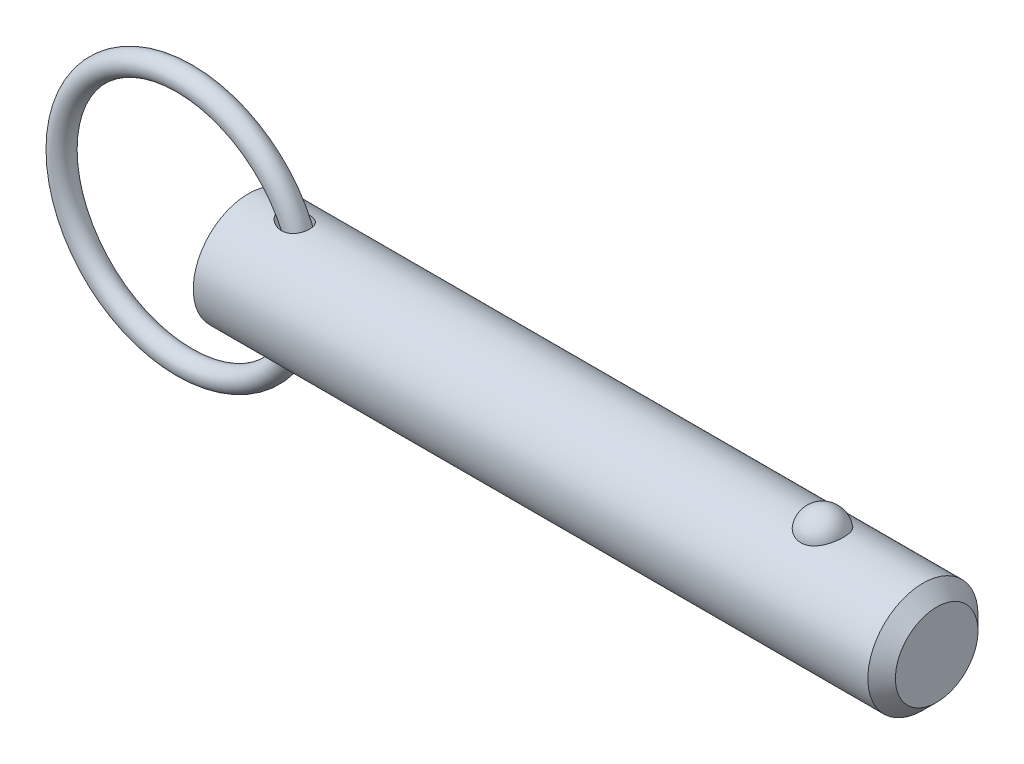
ISO-10303-21;
HEADER;
FILE_DESCRIPTION(('STEP AP214'),'2;1');
FILE_NAME('part.step','',(''),(''),'','','');
FILE_SCHEMA(('AUTOMOTIVE_DESIGN { 1 0 10303 214 1 1 1 1 }'));
ENDSEC;
DATA;
#1=APPLICATION_CONTEXT('core data for automotive mechanical design processes');
#2=APPLICATION_PROTOCOL_DEFINITION('international standard','automotive_design',2000,#1);
#3=PRODUCT_CONTEXT('',#1,'mechanical');
#4=PRODUCT('Part','Part','',(#3));
#5=PRODUCT_RELATED_PRODUCT_CATEGORY('part','',(#4));
#6=PRODUCT_DEFINITION_FORMATION('','',#4);
#7=PRODUCT_DEFINITION_CONTEXT('part definition',#1,'design');
#8=PRODUCT_DEFINITION('design','',#6,#7);
#9=PRODUCT_DEFINITION_SHAPE('','',#8);
#10=(LENGTH_UNIT() NAMED_UNIT(*) SI_UNIT(.MILLI.,.METRE.));
#11=(NAMED_UNIT(*) PLANE_ANGLE_UNIT() SI_UNIT($,.RADIAN.));
#12=(NAMED_UNIT(*) SI_UNIT($,.STERADIAN.) SOLID_ANGLE_UNIT());
#13=UNCERTAINTY_MEASURE_WITH_UNIT(LENGTH_MEASURE(1.E-05),#10,'distance_accuracy_value','');
#14=(GEOMETRIC_REPRESENTATION_CONTEXT(3) GLOBAL_UNCERTAINTY_ASSIGNED_CONTEXT((#13)) GLOBAL_UNIT_ASSIGNED_CONTEXT((#10,
#11,#12)) REPRESENTATION_CONTEXT('',''));
#15=CARTESIAN_POINT('',(0.,0.,0.));
#16=DIRECTION('',(0.,0.,1.));
#17=DIRECTION('',(1.,0.,0.));
#18=AXIS2_PLACEMENT_3D('',#15,#16,#17);
#19=CARTESIAN_POINT('',(-8.23730968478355,0.,0.));
#20=DIRECTION('',(0.,0.,1.));
#21=DIRECTION('',(1.,0.,0.));
#22=AXIS2_PLACEMENT_3D('',#19,#20,#21);
#23=TOROIDAL_SURFACE('',#22,15.875,1.422);
#24=CARTESIAN_POINT('',(9.05969031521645,0.,0.));
#25=VERTEX_POINT('',#24);
#26=VERTEX_LOOP('',#25);
#27=FACE_BOUND('',#26,.T.);
#28=ADVANCED_FACE('P0_F12',(#27),#23,.T.);
#29=CLOSED_SHELL('',(#28));
#30=MANIFOLD_SOLID_BREP('P0_B1',#29);
#31=CARTESIAN_POINT('',(0.,0.,0.));
#32=DIRECTION('',(1.,0.,0.));
#33=DIRECTION('',(0.,0.,-1.));
#34=AXIS2_PLACEMENT_3D('',#31,#32,#33);
#35=CYLINDRICAL_SURFACE('',#34,7.11);
#36=CARTESIAN_POINT('',(3.98467340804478,7.10072679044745,-0.363013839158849));
#37=CARTESIAN_POINT('',(4.00971652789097,7.09600153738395,-0.45539194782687));
#38=CARTESIAN_POINT('',(4.04401947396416,7.08958406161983,-0.545230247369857));
#39=CARTESIAN_POINT('',(4.12810160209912,7.07427055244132,-0.717157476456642));
#40=CARTESIAN_POINT('',(4.17791765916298,7.06536861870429,-0.799227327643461));
#41=CARTESIAN_POINT('',(4.28924471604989,7.04620300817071,-0.953469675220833));
#42=CARTESIAN_POINT('',(4.35063580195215,7.035953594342,-1.02573162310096));
#43=CARTESIAN_POINT('',(4.48282610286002,7.01493313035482,-1.16081412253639));
#44=CARTESIAN_POINT('',(4.55362244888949,7.00416223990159,-1.22363754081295));
#45=CARTESIAN_POINT('',(4.71659336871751,6.98090398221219,-1.35055080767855));
#46=CARTESIAN_POINT('',(4.81029272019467,6.96847103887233,-1.41269256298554));
#47=CARTESIAN_POINT('',(5.0057240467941,6.94515366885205,-1.52319699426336));
#48=CARTESIAN_POINT('',(5.10746392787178,6.93427079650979,-1.57154588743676));
#49=CARTESIAN_POINT('',(5.33503739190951,6.91346066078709,-1.66091325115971));
#50=CARTESIAN_POINT('',(5.46199550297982,6.90402388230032,-1.69921932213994));
#51=CARTESIAN_POINT('',(5.72084799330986,6.89024030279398,-1.75428261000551));
#52=CARTESIAN_POINT('',(5.85274301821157,6.88589416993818,-1.77103699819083));
#53=CARTESIAN_POINT('',(6.11557710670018,6.88337277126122,-1.78081990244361));
#54=CARTESIAN_POINT('',(6.24650031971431,6.88510489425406,-1.77420448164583));
#55=CARTESIAN_POINT('',(6.50446311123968,6.89478744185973,-1.73620392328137));
#56=CARTESIAN_POINT('',(6.6315075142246,6.90272978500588,-1.70485097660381));
#57=CARTESIAN_POINT('',(6.85933269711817,6.92243075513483,-1.62281888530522));
#58=CARTESIAN_POINT('',(6.96133251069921,6.93352131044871,-1.5753580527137));
#59=CARTESIAN_POINT('',(7.15436649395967,6.95824811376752,-1.46226310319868));
#60=CARTESIAN_POINT('',(7.24540699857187,6.97188287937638,-1.3966395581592));
#61=CARTESIAN_POINT('',(7.40446019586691,6.99838217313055,-1.25668991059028));
#62=CARTESIAN_POINT('',(7.473875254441,7.01118308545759,-1.18393777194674));
#63=CARTESIAN_POINT('',(7.59904891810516,7.03582803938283,-1.02736918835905));
#64=CARTESIAN_POINT('',(7.65481029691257,7.04767227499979,-0.943554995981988));
#65=CARTESIAN_POINT('',(7.74982438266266,7.06873077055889,-0.76979592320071));
#66=CARTESIAN_POINT('',(7.7894903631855,7.07800861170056,-0.680084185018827));
#67=CARTESIAN_POINT('',(7.85354088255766,7.09334756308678,-0.495102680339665));
#68=CARTESIAN_POINT('',(7.87792559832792,7.09940871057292,-0.399832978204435));
#69=CARTESIAN_POINT('',(7.9108898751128,7.10766731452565,-0.206294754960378));
#70=CARTESIAN_POINT('',(7.91944662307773,7.10985919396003,-0.108022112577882));
#71=CARTESIAN_POINT('',(7.920501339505,7.11012756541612,0.0886168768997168));
#72=CARTESIAN_POINT('',(7.91299895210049,7.10820396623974,0.186983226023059));
#73=CARTESIAN_POINT('',(7.88205794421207,7.10043733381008,0.381270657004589));
#74=CARTESIAN_POINT('',(7.85857985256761,7.09458459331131,0.477185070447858));
#75=CARTESIAN_POINT('',(7.79617406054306,7.07958431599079,0.663575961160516));
#76=CARTESIAN_POINT('',(7.75724672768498,7.07043685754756,0.754052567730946));
#77=CARTESIAN_POINT('',(7.66496731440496,7.04987259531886,0.926798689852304));
#78=CARTESIAN_POINT('',(7.61164530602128,7.0384605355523,1.00908483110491));
#79=CARTESIAN_POINT('',(7.49191707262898,7.01461776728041,1.16333092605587));
#80=CARTESIAN_POINT('',(7.42551210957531,7.00218715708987,1.235291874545));
#81=CARTESIAN_POINT('',(7.28164031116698,6.97770944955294,1.36680167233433));
#82=CARTESIAN_POINT('',(7.20420170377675,6.96566146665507,1.42638126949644));
#83=CARTESIAN_POINT('',(7.0403906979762,6.94319963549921,1.53199377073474));
#84=CARTESIAN_POINT('',(6.95401827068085,6.93278579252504,1.57802663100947));
#85=CARTESIAN_POINT('',(6.7731858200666,6.91444459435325,1.65656940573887));
#86=CARTESIAN_POINT('',(6.67860569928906,6.90656682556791,1.68881327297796));
#87=CARTESIAN_POINT('',(6.48544119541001,6.89422806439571,1.73849768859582));
#88=CARTESIAN_POINT('',(6.38685561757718,6.88976809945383,1.755933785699));
#89=CARTESIAN_POINT('',(6.18089829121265,6.88429907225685,1.77726234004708));
#90=CARTESIAN_POINT('',(6.07340937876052,6.88356485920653,1.78007646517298));
#91=CARTESIAN_POINT('',(5.85921220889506,6.886086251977,1.77029087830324));
#92=CARTESIAN_POINT('',(5.75250426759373,6.88934339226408,1.75768523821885));
#93=CARTESIAN_POINT('',(5.52848027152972,6.89994454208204,1.71563399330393));
#94=CARTESIAN_POINT('',(5.41155168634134,6.90775772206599,1.68424184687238));
#95=CARTESIAN_POINT('',(5.18376466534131,6.92670168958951,1.60454711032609));
#96=CARTESIAN_POINT('',(5.07291446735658,6.9378368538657,1.5562221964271));
#97=CARTESIAN_POINT('',(4.84835244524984,6.96347168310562,1.43744827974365));
#98=CARTESIAN_POINT('',(4.73562531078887,6.97820486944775,1.36517310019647));
#99=CARTESIAN_POINT('',(4.52504912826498,7.00822340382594,1.20158053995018));
#100=CARTESIAN_POINT('',(4.42717478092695,7.02350775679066,1.11029618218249));
#101=CARTESIAN_POINT('',(4.27935716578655,7.04784659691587,0.940654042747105));
#102=CARTESIAN_POINT('',(4.2239722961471,7.05736064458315,0.867099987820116));
#103=CARTESIAN_POINT('',(4.12558347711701,7.07469854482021,0.711919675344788));
#104=CARTESIAN_POINT('',(4.08256922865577,7.0825238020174,0.630300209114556));
#105=CARTESIAN_POINT('',(4.01142860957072,7.09565978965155,0.459428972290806));
#106=CARTESIAN_POINT('',(3.98346043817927,7.10094374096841,0.370107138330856));
#107=CARTESIAN_POINT('',(3.95517285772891,7.1063173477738,0.233358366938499));
#108=CARTESIAN_POINT('',(3.94802115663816,7.1076831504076,0.187321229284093));
#109=CARTESIAN_POINT('',(3.93842121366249,7.10951900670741,0.0947476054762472));
#110=CARTESIAN_POINT('',(3.93597129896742,7.10998937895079,0.0482113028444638));
#111=CARTESIAN_POINT('',(3.93584361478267,7.11001358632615,-0.0598597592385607));
#112=CARTESIAN_POINT('',(3.9399538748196,7.10922402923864,-0.121405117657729));
#113=CARTESIAN_POINT('',(3.95632793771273,7.10609781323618,-0.243320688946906));
#114=CARTESIAN_POINT('',(3.96859135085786,7.10376122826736,-0.303690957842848));
#115=CARTESIAN_POINT('',(3.98467340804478,7.10072679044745,-0.363013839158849));
#116=B_SPLINE_CURVE_WITH_KNOTS('',3,(#36,#37,#38,#39,#40,#41,#42,#43,#44,#45,#46,#47,#48,#49,
#50,#51,#52,#53,#54,#55,#56,#57,#58,#59,#60,#61,#62,#63,#64,#65,#66,#67,#68,#69,#70,#71,#72,#73,
#74,#75,#76,#77,#78,#79,#80,#81,#82,#83,#84,#85,#86,#87,#88,#89,#90,#91,#92,#93,#94,#95,#96,#97,
#98,#99,#100,#101,#102,#103,#104,#105,#106,#107,#108,#109,#110,#111,#112,#113,#114,#115),
.UNSPECIFIED.,.T.,.F.,(4,2,2,2,2,2,2,2,2,2,2,2,2,2,2,2,2,2,2,2,2,2,2,2,2,2,2,2,2,2,2,2,2,2,2,2,
2,2,2,4),(0.,0.287206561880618,0.575101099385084,0.860162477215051,1.14513709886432,
1.48324846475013,1.82169652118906,2.21865672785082,2.6156690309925,3.00665870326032,
3.39714041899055,3.73437585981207,4.07141541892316,4.37402271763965,4.67656849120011,
4.97076150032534,5.26495110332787,5.55956439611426,5.85418421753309,6.14953461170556,
6.44487798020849,6.73960905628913,7.03431171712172,7.32827352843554,7.6222362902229,
7.9216396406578,8.22113296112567,8.54242840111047,8.86384740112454,9.22635035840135,
9.58933304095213,9.99153142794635,10.3930368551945,10.6697219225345,10.9461759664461,
11.2254825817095,11.3650959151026,11.5046595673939,11.6891051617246,11.8735419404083),.UNSPECIFIED.);
#117=CARTESIAN_POINT('',(3.98467340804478,7.10072679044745,-0.363013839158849));
#118=VERTEX_POINT('',#117);
#119=EDGE_CURVE('P1_E40',#118,#118,#116,.T.);
#120=ORIENTED_EDGE('',*,*,#119,.T.);
#121=EDGE_LOOP('',(#120));
#122=FACE_BOUND('',#121,.T.);
#123=CARTESIAN_POINT('',(87.0925,0.,0.));
#124=DIRECTION('',(1.,0.,0.));
#125=DIRECTION('',(0.,0.,-1.));
#126=AXIS2_PLACEMENT_3D('',#123,#124,#125);
#127=CIRCLE('',#126,7.11);
#128=CARTESIAN_POINT('',(87.0925,0.,-7.11));
#129=VERTEX_POINT('',#128);
#130=EDGE_CURVE('P1_E25',#129,#129,#127,.T.);
#131=ORIENTED_EDGE('',*,*,#130,.F.);
#132=EDGE_LOOP('',(#131));
#133=FACE_BOUND('',#132,.T.);
#134=CARTESIAN_POINT('',(0.,0.,0.));
#135=DIRECTION('',(1.,0.,0.));
#136=DIRECTION('',(0.,0.,-1.));
#137=AXIS2_PLACEMENT_3D('',#134,#135,#136);
#138=CIRCLE('',#137,7.11);
#139=CARTESIAN_POINT('',(0.,0.,-7.11));
#140=VERTEX_POINT('',#139);
#141=EDGE_CURVE('P1_E9',#140,#140,#138,.T.);
#142=ORIENTED_EDGE('',*,*,#141,.T.);
#143=EDGE_LOOP('',(#142));
#144=FACE_BOUND('',#143,.T.);
#145=CARTESIAN_POINT('',(74.129258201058,6.5364666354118,2.79762469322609));
#146=CARTESIAN_POINT('',(73.9844296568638,6.53647876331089,2.79761243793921));
#147=CARTESIAN_POINT('',(73.839368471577,6.54144531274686,2.78608115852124));
#148=CARTESIAN_POINT('',(73.5532920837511,6.56077791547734,2.7402328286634));
#149=CARTESIAN_POINT('',(73.4122884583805,6.5751685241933,2.7058562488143));
#150=CARTESIAN_POINT('',(73.1388833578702,6.61165072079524,2.61544042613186));
#151=CARTESIAN_POINT('',(73.0064602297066,6.63372195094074,2.55945840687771));
#152=CARTESIAN_POINT('',(72.7532337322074,6.68316012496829,2.42742958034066));
#153=CARTESIAN_POINT('',(72.6324254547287,6.71052481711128,2.35139129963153));
#154=CARTESIAN_POINT('',(72.4016372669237,6.76860821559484,2.17866150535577));
#155=CARTESIAN_POINT('',(72.2920857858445,6.79940242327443,2.0814234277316));
#156=CARTESIAN_POINT('',(72.0903340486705,6.86050242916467,1.87020907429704));
#157=CARTESIAN_POINT('',(71.9981390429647,6.89080807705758,1.75622775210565));
#158=CARTESIAN_POINT('',(71.8292547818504,6.94923069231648,1.50900646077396));
#159=CARTESIAN_POINT('',(71.7534289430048,6.97719213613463,1.37513873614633));
#160=CARTESIAN_POINT('',(71.6242063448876,7.02647251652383,1.09584817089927));
#161=CARTESIAN_POINT('',(71.5708109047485,7.04779106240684,0.95042465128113));
#162=CARTESIAN_POINT('',(71.4871019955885,7.08180248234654,0.650508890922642));
#163=CARTESIAN_POINT('',(71.4570253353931,7.09440672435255,0.495940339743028));
#164=CARTESIAN_POINT('',(71.4214735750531,7.10935121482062,0.183515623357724));
#165=CARTESIAN_POINT('',(71.4159974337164,7.11169189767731,0.0256595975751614));
#166=CARTESIAN_POINT('',(71.429700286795,7.10589702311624,-0.28751219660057));
#167=CARTESIAN_POINT('',(71.4486823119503,7.0978451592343,-0.442838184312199));
#168=CARTESIAN_POINT('',(71.5105745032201,7.07221860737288,-0.747830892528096));
#169=CARTESIAN_POINT('',(71.5534850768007,7.05464375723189,-0.897497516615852));
#170=CARTESIAN_POINT('',(71.6624527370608,7.01171031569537,-1.18722864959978));
#171=CARTESIAN_POINT('',(71.7285458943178,6.98633960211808,-1.32727778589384));
#172=CARTESIAN_POINT('',(71.8825362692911,6.93042258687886,-1.59370324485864));
#173=CARTESIAN_POINT('',(71.9704355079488,6.89987580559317,-1.72007829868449));
#174=CARTESIAN_POINT('',(72.1669269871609,6.83659510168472,-1.95657345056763));
#175=CARTESIAN_POINT('',(72.2756640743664,6.80384697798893,-2.06656957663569));
#176=CARTESIAN_POINT('',(72.5109686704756,6.74001831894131,-2.26611005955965));
#177=CARTESIAN_POINT('',(72.6375350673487,6.70893767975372,-2.35565569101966));
#178=CARTESIAN_POINT('',(72.9028454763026,6.6526444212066,-2.51019726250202));
#179=CARTESIAN_POINT('',(73.0413230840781,6.62733449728,-2.57561395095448));
#180=CARTESIAN_POINT('',(73.3285194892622,6.58495995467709,-2.68211134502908));
#181=CARTESIAN_POINT('',(73.4772343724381,6.56789220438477,-2.7232012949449));
#182=CARTESIAN_POINT('',(73.7726268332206,6.54478663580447,-2.77825810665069));
#183=CARTESIAN_POINT('',(73.9190295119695,6.53823639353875,-2.79348727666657));
#184=CARTESIAN_POINT('',(74.2124700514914,6.53532718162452,-2.80028921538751));
#185=CARTESIAN_POINT('',(74.3595077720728,6.53896606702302,-2.79186696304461));
#186=CARTESIAN_POINT('',(74.6449210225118,6.55570357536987,-2.75232178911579));
#187=CARTESIAN_POINT('',(74.7834221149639,6.56848455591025,-2.72196077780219));
#188=CARTESIAN_POINT('',(75.0531142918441,6.60173528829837,-2.64028774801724));
#189=CARTESIAN_POINT('',(75.184304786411,6.62220565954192,-2.58897404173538));
#190=CARTESIAN_POINT('',(75.4388462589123,6.6691792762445,-2.46547820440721));
#191=CARTESIAN_POINT('',(75.5619691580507,6.69580233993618,-2.39287266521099));
#192=CARTESIAN_POINT('',(75.7944418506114,6.75207041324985,-2.22915269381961));
#193=CARTESIAN_POINT('',(75.9037884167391,6.78171612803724,-2.13803393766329));
#194=CARTESIAN_POINT('',(76.111642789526,6.84264629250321,-1.93445592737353));
#195=CARTESIAN_POINT('',(76.2093178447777,6.87393748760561,-1.82114774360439));
#196=CARTESIAN_POINT('',(76.3850112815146,6.93345710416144,-1.57947787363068));
#197=CARTESIAN_POINT('',(76.4630261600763,6.96168497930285,-1.45111351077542));
#198=CARTESIAN_POINT('',(76.5999857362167,7.01307558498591,-1.17842708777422));
#199=CARTESIAN_POINT('',(76.6582588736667,7.03605262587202,-1.03373189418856));
#200=CARTESIAN_POINT('',(76.7510815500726,7.07340932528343,-0.735867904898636));
#201=CARTESIAN_POINT('',(76.7856311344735,7.08778900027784,-0.582699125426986));
#202=CARTESIAN_POINT('',(76.830274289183,7.10647639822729,-0.272420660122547));
#203=CARTESIAN_POINT('',(76.84039710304,7.11079616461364,-0.115315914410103));
#204=CARTESIAN_POINT('',(76.836061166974,7.10896059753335,0.198488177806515));
#205=CARTESIAN_POINT('',(76.8216031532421,7.10280557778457,0.355187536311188));
#206=CARTESIAN_POINT('',(76.7685727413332,7.08071500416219,0.662724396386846));
#207=CARTESIAN_POINT('',(76.7301505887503,7.06484039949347,0.813592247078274));
#208=CARTESIAN_POINT('',(76.630101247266,7.02495896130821,1.10629159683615));
#209=CARTESIAN_POINT('',(76.5684724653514,7.00095156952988,1.24812247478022));
#210=CARTESIAN_POINT('',(76.4227668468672,6.94706632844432,1.51976439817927));
#211=CARTESIAN_POINT('',(76.3385448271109,6.91715085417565,1.64949012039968));
#212=CARTESIAN_POINT('',(76.1495861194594,6.8547056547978,1.89231285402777));
#213=CARTESIAN_POINT('',(76.0448501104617,6.82217601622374,2.00541041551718));
#214=CARTESIAN_POINT('',(75.8171030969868,6.75805358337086,2.21190674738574));
#215=CARTESIAN_POINT('',(75.694082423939,6.72646129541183,2.30529503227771));
#216=CARTESIAN_POINT('',(75.4327347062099,6.66789520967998,2.46959908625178));
#217=CARTESIAN_POINT('',(75.2944019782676,6.64092313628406,2.54050647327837));
#218=CARTESIAN_POINT('',(75.0111828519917,6.59572583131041,2.65560045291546));
#219=CARTESIAN_POINT('',(74.8666660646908,6.57724013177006,2.70059539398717));
#220=CARTESIAN_POINT('',(74.5715469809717,6.55006426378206,2.76587321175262));
#221=CARTESIAN_POINT('',(74.4209640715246,6.54134511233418,2.78622922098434));
#222=CARTESIAN_POINT('',(74.2230463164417,6.53697847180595,2.79642434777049));
#223=CARTESIAN_POINT('',(74.1761644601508,6.53646270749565,2.79762866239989));
#224=CARTESIAN_POINT('',(74.129258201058,6.5364666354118,2.79762469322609));
#225=B_SPLINE_CURVE_WITH_KNOTS('',3,(#145,#146,#147,#148,#149,#150,#151,#152,#153,#154,#155,
#156,#157,#158,#159,#160,#161,#162,#163,#164,#165,#166,#167,#168,#169,#170,#171,#172,#173,#174,
#175,#176,#177,#178,#179,#180,#181,#182,#183,#184,#185,#186,#187,#188,#189,#190,#191,#192,#193,
#194,#195,#196,#197,#198,#199,#200,#201,#202,#203,#204,#205,#206,#207,#208,#209,#210,#211,#212,
#213,#214,#215,#216,#217,#218,#219,#220,#221,#222,#223,#224),.UNSPECIFIED.,.T.,.F.,(4,2,2,2,2,2,
2,2,2,2,2,2,2,2,2,2,2,2,2,2,2,2,2,2,2,2,2,2,2,2,2,2,2,2,2,2,2,2,2,4),(0.,0.434355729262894,
0.869847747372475,1.30419416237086,1.73835621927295,2.18541922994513,2.63261726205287,
3.09954261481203,3.56649542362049,4.03813031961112,4.5097452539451,4.97758575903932,
5.44543423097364,5.91401389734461,6.38263700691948,6.85464418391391,7.32662193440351,
7.78992971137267,8.25306131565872,8.69285754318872,9.13256119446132,9.5576862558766,
9.9828455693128,10.4171106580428,10.8514772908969,11.3079089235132,11.7644218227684,
12.2351898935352,12.7059570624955,13.1761603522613,13.6463495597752,14.1136200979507,
14.580922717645,15.0513032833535,15.5216682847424,15.9922828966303,16.4630727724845,
16.9182457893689,17.3720644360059,17.5127411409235),.UNSPECIFIED.);
#226=CARTESIAN_POINT('',(74.129258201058,6.5364666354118,2.79762469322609));
#227=VERTEX_POINT('',#226);
#228=EDGE_CURVE('P1_E34',#227,#227,#225,.T.);
#229=ORIENTED_EDGE('',*,*,#228,.T.);
#230=EDGE_LOOP('',(#229));
#231=FACE_BOUND('',#230,.T.);
#232=CARTESIAN_POINT('',(3.98467340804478,-7.10072679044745,-0.363013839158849));
#233=CARTESIAN_POINT('',(3.96426456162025,-7.10457733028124,-0.287714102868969));
#234=CARTESIAN_POINT('',(3.95000501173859,-7.10730349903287,-0.210695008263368));
#235=CARTESIAN_POINT('',(3.93481801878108,-7.11020840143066,-0.0553038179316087));
#236=CARTESIAN_POINT('',(3.93388435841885,-7.11038832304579,0.0230676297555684));
#237=CARTESIAN_POINT('',(3.94541910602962,-7.10817995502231,0.178714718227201));
#238=CARTESIAN_POINT('',(3.95787987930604,-7.10579312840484,0.25599095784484));
#239=CARTESIAN_POINT('',(3.99523775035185,-7.09872642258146,0.407352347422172));
#240=CARTESIAN_POINT('',(4.02014065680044,-7.09404547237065,0.481435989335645));
#241=CARTESIAN_POINT('',(4.08119600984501,-7.08278363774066,0.625775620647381));
#242=CARTESIAN_POINT('',(4.11749458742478,-7.07617815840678,0.695967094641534));
#243=CARTESIAN_POINT('',(4.19940836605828,-7.06165305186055,0.830508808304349));
#244=CARTESIAN_POINT('',(4.24502952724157,-7.0537325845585,0.894855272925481));
#245=CARTESIAN_POINT('',(4.36790232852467,-7.03310314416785,1.04688574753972));
#246=CARTESIAN_POINT('',(4.44977459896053,-7.01993229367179,1.13078695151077));
#247=CARTESIAN_POINT('',(4.62610796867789,-6.99351259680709,1.28411726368));
#248=CARTESIAN_POINT('',(4.7205898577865,-6.98026365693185,1.35352197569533));
#249=CARTESIAN_POINT('',(4.92036507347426,-6.9549104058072,1.47831921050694));
#250=CARTESIAN_POINT('',(5.02579054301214,-6.94282458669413,1.53350332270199));
#251=CARTESIAN_POINT('',(5.24378330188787,-6.92129098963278,1.62793610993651));
#252=CARTESIAN_POINT('',(5.35635066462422,-6.91184323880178,1.66718462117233));
#253=CARTESIAN_POINT('',(5.60134354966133,-6.89573491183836,1.73269893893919));
#254=CARTESIAN_POINT('',(5.73444697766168,-6.8895970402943,1.75661057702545));
#255=CARTESIAN_POINT('',(6.00300738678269,-6.88344616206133,1.78057487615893));
#256=CARTESIAN_POINT('',(6.13846360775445,-6.88343121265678,1.78063510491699));
#257=CARTESIAN_POINT('',(6.39660470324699,-6.88981379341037,1.75576480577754));
#258=CARTESIAN_POINT('',(6.51947843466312,-6.89572457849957,1.73273121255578));
#259=CARTESIAN_POINT('',(6.75813770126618,-6.91274434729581,1.66352936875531));
#260=CARTESIAN_POINT('',(6.87393155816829,-6.92384709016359,1.61738888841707));
#261=CARTESIAN_POINT('',(7.07801861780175,-6.94787316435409,1.51052664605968));
#262=CARTESIAN_POINT('',(7.16789841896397,-6.96033024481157,1.45271574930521));
#263=CARTESIAN_POINT('',(7.33546773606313,-6.98638661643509,1.32171912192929));
#264=CARTESIAN_POINT('',(7.41316182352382,-6.99998547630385,1.24853918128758));
#265=CARTESIAN_POINT('',(7.54861420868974,-7.02559503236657,1.09486170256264));
#266=CARTESIAN_POINT('',(7.60741145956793,-7.03764930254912,1.01528346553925));
#267=CARTESIAN_POINT('',(7.71070740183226,-7.0598657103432,0.847099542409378));
#268=CARTESIAN_POINT('',(7.75520788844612,-7.0700280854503,0.758494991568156));
#269=CARTESIAN_POINT('',(7.82836147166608,-7.08722075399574,0.575936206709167));
#270=CARTESIAN_POINT('',(7.85719783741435,-7.09428707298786,0.482058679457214));
#271=CARTESIAN_POINT('',(7.89918378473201,-7.10470260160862,0.29065874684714));
#272=CARTESIAN_POINT('',(7.91233308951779,-7.10805174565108,0.193136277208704));
#273=CARTESIAN_POINT('',(7.92267451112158,-7.11067890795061,-0.00313968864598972));
#274=CARTESIAN_POINT('',(7.91981203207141,-7.10994299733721,-0.10189624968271));
#275=CARTESIAN_POINT('',(7.89806489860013,-7.10444651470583,-0.297516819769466));
#276=CARTESIAN_POINT('',(7.87918005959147,-7.09968589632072,-0.394380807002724));
#277=CARTESIAN_POINT('',(7.82577988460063,-7.0866471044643,-0.58355375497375));
#278=CARTESIAN_POINT('',(7.79124976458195,-7.07836560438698,-0.675858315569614));
#279=CARTESIAN_POINT('',(7.70736343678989,-7.05919003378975,-0.853167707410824));
#280=CARTESIAN_POINT('',(7.65800801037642,-7.04829610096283,-0.938172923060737));
#281=CARTESIAN_POINT('',(7.54590141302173,-7.02513961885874,-1.09819812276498));
#282=CARTESIAN_POINT('',(7.48319521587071,-7.01288172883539,-1.17325029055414));
#283=CARTESIAN_POINT('',(7.34599775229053,-6.98832192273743,-1.31164333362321));
#284=CARTESIAN_POINT('',(7.27150757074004,-6.97602001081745,-1.37498528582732));
#285=CARTESIAN_POINT('',(7.11277776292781,-6.95268608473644,-1.48849974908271));
#286=CARTESIAN_POINT('',(7.02852525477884,-6.94165578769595,-1.53865456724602));
#287=CARTESIAN_POINT('',(6.85282430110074,-6.92200320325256,-1.62478650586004));
#288=CARTESIAN_POINT('',(6.76137511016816,-6.91338116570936,-1.66076215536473));
#289=CARTESIAN_POINT('',(6.57061179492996,-6.89906044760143,-1.71930563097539));
#290=CARTESIAN_POINT('',(6.47113516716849,-6.89347290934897,-1.74136795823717));
#291=CARTESIAN_POINT('',(6.26989833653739,-6.88605020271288,-1.7704895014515));
#292=CARTESIAN_POINT('',(6.16813737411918,-6.88421630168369,-1.77754365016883));
#293=CARTESIAN_POINT('',(5.95492537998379,-6.88424071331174,-1.77745174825));
#294=CARTESIAN_POINT('',(5.8434768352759,-6.88646827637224,-1.76888555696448));
#295=CARTESIAN_POINT('',(5.62307560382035,-6.89483827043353,-1.73596677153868));
#296=CARTESIAN_POINT('',(5.51412477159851,-6.90098351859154,-1.71160281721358));
#297=CARTESIAN_POINT('',(5.28644478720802,-6.91743803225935,-1.64393691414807));
#298=CARTESIAN_POINT('',(5.16837217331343,-6.92819628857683,-1.59852806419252));
#299=CARTESIAN_POINT('',(4.94091825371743,-6.95234836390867,-1.4899796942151));
#300=CARTESIAN_POINT('',(4.83153887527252,-6.96574276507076,-1.42683625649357));
#301=CARTESIAN_POINT('',(4.63576710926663,-6.99209234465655,-1.29112257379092));
#302=CARTESIAN_POINT('',(4.54816728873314,-7.00494184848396,-1.22027748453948));
#303=CARTESIAN_POINT('',(4.38554897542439,-7.03019055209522,-1.0652111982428));
#304=CARTESIAN_POINT('',(4.31052141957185,-7.04259007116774,-0.980999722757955));
#305=CARTESIAN_POINT('',(4.18551811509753,-7.0640229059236,-0.811206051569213));
#306=CARTESIAN_POINT('',(4.13358417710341,-7.07328321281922,-0.727107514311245));
#307=CARTESIAN_POINT('',(4.04607461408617,-7.0891994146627,-0.550580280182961));
#308=CARTESIAN_POINT('',(4.01046401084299,-7.09586087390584,-0.458169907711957));
#309=CARTESIAN_POINT('',(3.98467340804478,-7.10072679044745,-0.363013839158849));
#310=B_SPLINE_CURVE_WITH_KNOTS('',3,(#232,#233,#234,#235,#236,#237,#238,#239,#240,#241,#242,
#243,#244,#245,#246,#247,#248,#249,#250,#251,#252,#253,#254,#255,#256,#257,#258,#259,#260,#261,
#262,#263,#264,#265,#266,#267,#268,#269,#270,#271,#272,#273,#274,#275,#276,#277,#278,#279,#280,
#281,#282,#283,#284,#285,#286,#287,#288,#289,#290,#291,#292,#293,#294,#295,#296,#297,#298,#299,
#300,#301,#302,#303,#304,#305,#306,#307,#308,#309),.UNSPECIFIED.,.T.,.F.,(4,2,2,2,2,2,2,2,2,2,2,
2,2,2,2,2,2,2,2,2,2,2,2,2,2,2,2,2,2,2,2,2,2,2,2,2,2,2,4),(0.,0.23402065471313,0.467932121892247,
0.701710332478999,0.935597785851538,1.17261620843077,1.40978663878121,1.76177576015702,
2.11435255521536,2.47183528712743,2.8293216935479,3.23332937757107,3.63720887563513,
4.01042610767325,4.38319587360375,4.70425151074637,5.02518641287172,5.32277979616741,
5.62033579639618,5.91433101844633,6.2083314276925,6.50333490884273,6.79834178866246,
7.09362801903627,7.38889868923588,7.6831900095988,7.9774542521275,8.27211131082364,
8.56679892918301,8.8716552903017,9.17661456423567,9.51069129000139,9.84500851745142,
10.2243046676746,10.6036846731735,10.9425776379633,11.2812252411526,11.5775945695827,
11.8733258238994),.UNSPECIFIED.);
#311=CARTESIAN_POINT('',(3.98467340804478,-7.10072679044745,-0.363013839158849));
#312=VERTEX_POINT('',#311);
#313=EDGE_CURVE('P1_E17',#312,#312,#310,.T.);
#314=ORIENTED_EDGE('',*,*,#313,.T.);
#315=EDGE_LOOP('',(#314));
#316=FACE_BOUND('',#315,.T.);
#317=ADVANCED_FACE('P1_F13',(#122,#133,#144,#231,#316),#35,.T.);
#318=CARTESIAN_POINT('',(0.,0.,0.));
#319=DIRECTION('',(-1.,0.,0.));
#320=DIRECTION('',(0.,0.,1.));
#321=AXIS2_PLACEMENT_3D('',#318,#319,#320);
#322=PLANE('',#321);
#323=ORIENTED_EDGE('',*,*,#141,.F.);
#324=EDGE_LOOP('',(#323));
#325=FACE_BOUND('',#324,.T.);
#326=ADVANCED_FACE('P1_F15',(#325),#322,.T.);
#327=CARTESIAN_POINT('',(88.87,0.,0.));
#328=DIRECTION('',(-1.,0.,0.));
#329=DIRECTION('',(0.,0.,1.));
#330=AXIS2_PLACEMENT_3D('',#327,#328,#329);
#331=CONICAL_SURFACE('',#330,5.33250000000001,0.785398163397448);
#332=ORIENTED_EDGE('',*,*,#130,.T.);
#333=EDGE_LOOP('',(#332));
#334=FACE_BOUND('',#333,.T.);
#335=CARTESIAN_POINT('',(88.87,0.,0.));
#336=DIRECTION('',(1.,0.,0.));
#337=DIRECTION('',(0.,0.,-1.));
#338=AXIS2_PLACEMENT_3D('',#335,#336,#337);
#339=CIRCLE('',#338,5.33250000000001);
#340=CARTESIAN_POINT('',(88.87,0.,-5.33250000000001));
#341=VERTEX_POINT('',#340);
#342=EDGE_CURVE('P1_E30',#341,#341,#339,.T.);
#343=ORIENTED_EDGE('',*,*,#342,.F.);
#344=EDGE_LOOP('',(#343));
#345=FACE_BOUND('',#344,.T.);
#346=ADVANCED_FACE('P1_F55',(#334,#345),#331,.T.);
#347=CARTESIAN_POINT('',(88.87,5.33250000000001,0.));
#348=DIRECTION('',(1.,0.,0.));
#349=DIRECTION('',(0.,0.,-1.));
#350=AXIS2_PLACEMENT_3D('',#347,#348,#349);
#351=PLANE('',#350);
#352=ORIENTED_EDGE('',*,*,#342,.T.);
#353=EDGE_LOOP('',(#352));
#354=FACE_BOUND('',#353,.T.);
#355=ADVANCED_FACE('P1_F51',(#354),#351,.T.);
#356=CARTESIAN_POINT('',(74.129258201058,6.399,0.));
#357=DIRECTION('',(-1.,0.,0.));
#358=DIRECTION('',(0.,1.,0.));
#359=AXIS2_PLACEMENT_3D('',#356,#357,#358);
#360=SPHERICAL_SURFACE('',#359,2.80099999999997);
#361=ORIENTED_EDGE('',*,*,#228,.F.);
#362=EDGE_LOOP('',(#361));
#363=FACE_BOUND('',#362,.T.);
#364=ADVANCED_FACE('P1_F46',(#363),#360,.T.);
#365=CARTESIAN_POINT('',(-8.23730968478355,0.,0.));
#366=DIRECTION('',(0.,0.,1.));
#367=DIRECTION('',(1.,0.,0.));
#368=AXIS2_PLACEMENT_3D('',#365,#366,#367);
#369=TOROIDAL_SURFACE('',#368,15.875,1.7775);
#370=ORIENTED_EDGE('',*,*,#313,.F.);
#371=EDGE_LOOP('',(#370));
#372=FACE_BOUND('',#371,.T.);
#373=ORIENTED_EDGE('',*,*,#119,.F.);
#374=EDGE_LOOP('',(#373));
#375=FACE_BOUND('',#374,.T.);
#376=ADVANCED_FACE('P1_F50',(#372,#375),#369,.F.);
#377=CLOSED_SHELL('',(#317,#326,#346,#355,#364,#376));
#378=MANIFOLD_SOLID_BREP('P1_B1',#377);
#379=ADVANCED_BREP_SHAPE_REPRESENTATION('',(#18,#30,#378),#14);
#380=SHAPE_DEFINITION_REPRESENTATION(#9,#379);
ENDSEC;
END-ISO-10303-21;
